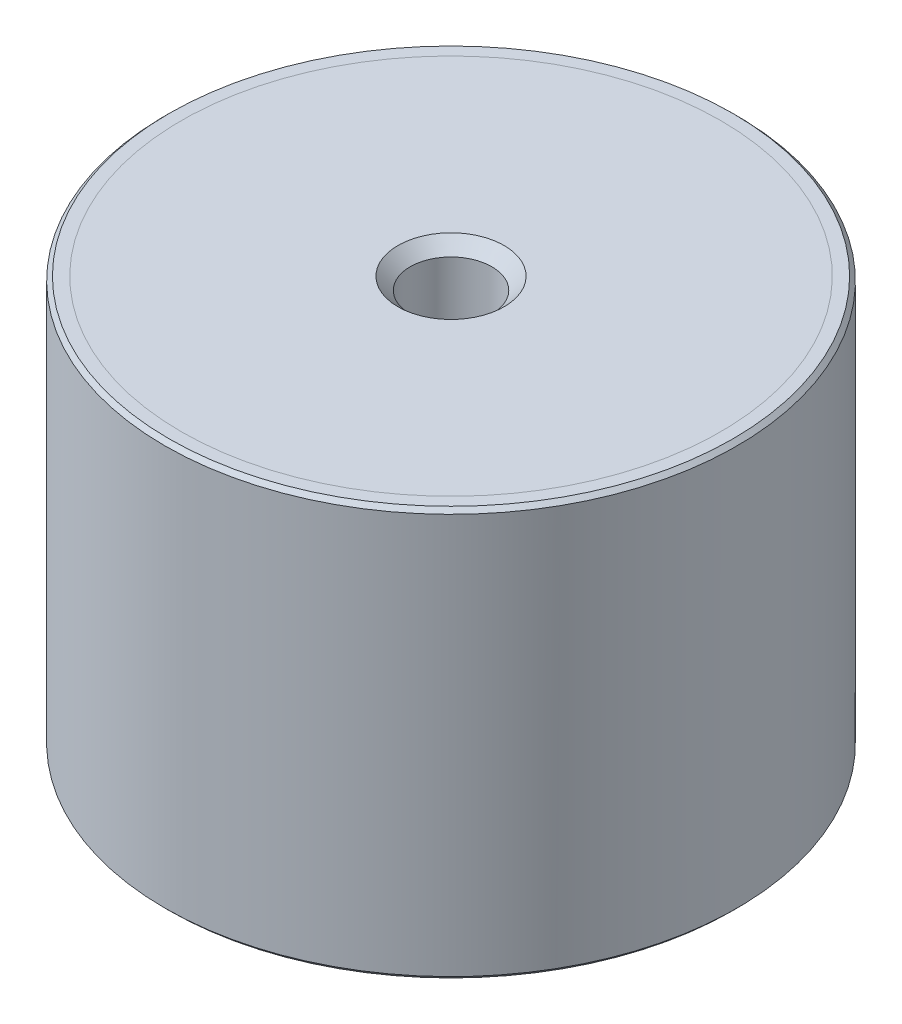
ISO-10303-21;
HEADER;
FILE_DESCRIPTION(('STEP AP214'),'2;1');
FILE_NAME('part.step','',(''),(''),'','','');
FILE_SCHEMA(('AUTOMOTIVE_DESIGN { 1 0 10303 214 1 1 1 1 }'));
ENDSEC;
DATA;
#1=APPLICATION_CONTEXT('core data for automotive mechanical design processes');
#2=APPLICATION_PROTOCOL_DEFINITION('international standard','automotive_design',2000,#1);
#3=PRODUCT_CONTEXT('',#1,'mechanical');
#4=PRODUCT('Part','Part','',(#3));
#5=PRODUCT_RELATED_PRODUCT_CATEGORY('part','',(#4));
#6=PRODUCT_DEFINITION_FORMATION('','',#4);
#7=PRODUCT_DEFINITION_CONTEXT('part definition',#1,'design');
#8=PRODUCT_DEFINITION('design','',#6,#7);
#9=PRODUCT_DEFINITION_SHAPE('','',#8);
#10=(LENGTH_UNIT() NAMED_UNIT(*) SI_UNIT(.MILLI.,.METRE.));
#11=(NAMED_UNIT(*) PLANE_ANGLE_UNIT() SI_UNIT($,.RADIAN.));
#12=(NAMED_UNIT(*) SI_UNIT($,.STERADIAN.) SOLID_ANGLE_UNIT());
#13=UNCERTAINTY_MEASURE_WITH_UNIT(LENGTH_MEASURE(1.E-05),#10,'distance_accuracy_value','');
#14=(GEOMETRIC_REPRESENTATION_CONTEXT(3) GLOBAL_UNCERTAINTY_ASSIGNED_CONTEXT((#13)) GLOBAL_UNIT_ASSIGNED_CONTEXT((#10,
#11,#12)) REPRESENTATION_CONTEXT('',''));
#15=CARTESIAN_POINT('',(0.,0.,0.));
#16=DIRECTION('',(0.,0.,1.));
#17=DIRECTION('',(1.,0.,0.));
#18=AXIS2_PLACEMENT_3D('',#15,#16,#17);
#19=CARTESIAN_POINT('',(0.,-47.,5.));
#20=DIRECTION('',(0.,1.,0.));
#21=DIRECTION('',(0.,0.,1.));
#22=AXIS2_PLACEMENT_3D('',#19,#20,#21);
#23=PLANE('',#22);
#24=CARTESIAN_POINT('',(0.,-47.,0.));
#25=DIRECTION('',(0.,1.,0.));
#26=DIRECTION('',(0.,0.,1.));
#27=AXIS2_PLACEMENT_3D('',#24,#25,#26);
#28=CIRCLE('',#27,33.);
#29=CARTESIAN_POINT('',(0.,-47.,33.));
#30=VERTEX_POINT('',#29);
#31=EDGE_CURVE('P0_E25',#30,#30,#28,.T.);
#32=ORIENTED_EDGE('',*,*,#31,.T.);
#33=EDGE_LOOP('',(#32));
#34=FACE_BOUND('',#33,.T.);
#35=CARTESIAN_POINT('',(0.,-47.,0.));
#36=DIRECTION('',(0.,1.,0.));
#37=DIRECTION('',(0.,0.,1.));
#38=AXIS2_PLACEMENT_3D('',#35,#36,#37);
#39=CIRCLE('',#38,5.);
#40=CARTESIAN_POINT('',(0.,-47.,5.));
#41=VERTEX_POINT('',#40);
#42=EDGE_CURVE('P0_E21',#41,#41,#39,.T.);
#43=ORIENTED_EDGE('',*,*,#42,.F.);
#44=EDGE_LOOP('',(#43));
#45=FACE_BOUND('',#44,.T.);
#46=ADVANCED_FACE('P0_F14',(#34,#45),#23,.T.);
#47=CARTESIAN_POINT('',(0.,21.0340428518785,0.));
#48=DIRECTION('',(0.,1.,0.));
#49=DIRECTION('',(0.,0.,1.));
#50=AXIS2_PLACEMENT_3D('',#47,#48,#49);
#51=CYLINDRICAL_SURFACE('',#50,33.);
#52=CARTESIAN_POINT('',(0.,-48.5,0.));
#53=DIRECTION('',(0.,1.,0.));
#54=DIRECTION('',(0.,0.,1.));
#55=AXIS2_PLACEMENT_3D('',#52,#53,#54);
#56=CIRCLE('',#55,33.);
#57=CARTESIAN_POINT('',(0.,-48.5,33.));
#58=VERTEX_POINT('',#57);
#59=EDGE_CURVE('P0_E29',#58,#58,#56,.T.);
#60=ORIENTED_EDGE('',*,*,#59,.T.);
#61=EDGE_LOOP('',(#60));
#62=FACE_BOUND('',#61,.T.);
#63=ORIENTED_EDGE('',*,*,#31,.F.);
#64=EDGE_LOOP('',(#63));
#65=FACE_BOUND('',#64,.T.);
#66=ADVANCED_FACE('P0_F35',(#62,#65),#51,.T.);
#67=CARTESIAN_POINT('',(0.,-48.5,33.));
#68=DIRECTION('',(0.,-1.,0.));
#69=DIRECTION('',(0.,0.,-1.));
#70=AXIS2_PLACEMENT_3D('',#67,#68,#69);
#71=PLANE('',#70);
#72=CARTESIAN_POINT('',(0.,-48.5,0.));
#73=DIRECTION('',(0.,-1.,0.));
#74=DIRECTION('',(0.,0.,-1.));
#75=AXIS2_PLACEMENT_3D('',#72,#73,#74);
#76=CIRCLE('',#75,6.50000000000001);
#77=CARTESIAN_POINT('',(0.,-48.5,-6.50000000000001));
#78=VERTEX_POINT('',#77);
#79=EDGE_CURVE('P0_E10',#78,#78,#76,.F.);
#80=ORIENTED_EDGE('',*,*,#79,.T.);
#81=EDGE_LOOP('',(#80));
#82=FACE_BOUND('',#81,.T.);
#83=ORIENTED_EDGE('',*,*,#59,.F.);
#84=EDGE_LOOP('',(#83));
#85=FACE_BOUND('',#84,.T.);
#86=ADVANCED_FACE('P0_F38',(#82,#85),#71,.T.);
#87=CARTESIAN_POINT('',(0.,-48.5,0.));
#88=DIRECTION('',(0.,-1.,0.));
#89=DIRECTION('',(0.,0.,-1.));
#90=AXIS2_PLACEMENT_3D('',#87,#88,#89);
#91=CONICAL_SURFACE('',#90,6.50000000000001,0.785398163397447);
#92=ORIENTED_EDGE('',*,*,#42,.T.);
#93=EDGE_LOOP('',(#92));
#94=FACE_BOUND('',#93,.T.);
#95=ORIENTED_EDGE('',*,*,#79,.F.);
#96=EDGE_LOOP('',(#95));
#97=FACE_BOUND('',#96,.T.);
#98=ADVANCED_FACE('P0_F16',(#94,#97),#91,.F.);
#99=CLOSED_SHELL('',(#46,#66,#86,#98));
#100=MANIFOLD_SOLID_BREP('P0_B1',#99);
#101=CARTESIAN_POINT('',(0.,1.5,5.));
#102=DIRECTION('',(0.,1.,0.));
#103=DIRECTION('',(0.,0.,1.));
#104=AXIS2_PLACEMENT_3D('',#101,#102,#103);
#105=PLANE('',#104);
#106=CARTESIAN_POINT('',(0.,1.5,0.));
#107=DIRECTION('',(0.,1.,0.));
#108=DIRECTION('',(0.,0.,1.));
#109=AXIS2_PLACEMENT_3D('',#106,#107,#108);
#110=CIRCLE('',#109,6.50000000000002);
#111=CARTESIAN_POINT('',(0.,1.5,6.50000000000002));
#112=VERTEX_POINT('',#111);
#113=EDGE_CURVE('P1_E10',#112,#112,#110,.F.);
#114=ORIENTED_EDGE('',*,*,#113,.T.);
#115=EDGE_LOOP('',(#114));
#116=FACE_BOUND('',#115,.T.);
#117=CARTESIAN_POINT('',(0.,1.5,0.));
#118=DIRECTION('',(0.,1.,0.));
#119=DIRECTION('',(0.,0.,1.));
#120=AXIS2_PLACEMENT_3D('',#117,#118,#119);
#121=CIRCLE('',#120,33.);
#122=CARTESIAN_POINT('',(0.,1.5,33.));
#123=VERTEX_POINT('',#122);
#124=EDGE_CURVE('P1_E21',#123,#123,#121,.T.);
#125=ORIENTED_EDGE('',*,*,#124,.T.);
#126=EDGE_LOOP('',(#125));
#127=FACE_BOUND('',#126,.T.);
#128=ADVANCED_FACE('P1_F14',(#116,#127),#105,.T.);
#129=CARTESIAN_POINT('',(0.,69.5340428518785,0.));
#130=DIRECTION('',(0.,1.,0.));
#131=DIRECTION('',(0.,0.,1.));
#132=AXIS2_PLACEMENT_3D('',#129,#130,#131);
#133=CYLINDRICAL_SURFACE('',#132,33.);
#134=CARTESIAN_POINT('',(0.,0.,0.));
#135=DIRECTION('',(0.,1.,0.));
#136=DIRECTION('',(0.,0.,1.));
#137=AXIS2_PLACEMENT_3D('',#134,#135,#136);
#138=CIRCLE('',#137,33.);
#139=CARTESIAN_POINT('',(0.,0.,33.));
#140=VERTEX_POINT('',#139);
#141=EDGE_CURVE('P1_E25',#140,#140,#138,.T.);
#142=ORIENTED_EDGE('',*,*,#141,.T.);
#143=EDGE_LOOP('',(#142));
#144=FACE_BOUND('',#143,.T.);
#145=ORIENTED_EDGE('',*,*,#124,.F.);
#146=EDGE_LOOP('',(#145));
#147=FACE_BOUND('',#146,.T.);
#148=ADVANCED_FACE('P1_F44',(#144,#147),#133,.T.);
#149=CARTESIAN_POINT('',(0.,0.,33.));
#150=DIRECTION('',(0.,-1.,0.));
#151=DIRECTION('',(0.,0.,-1.));
#152=AXIS2_PLACEMENT_3D('',#149,#150,#151);
#153=PLANE('',#152);
#154=CARTESIAN_POINT('',(0.,0.,0.));
#155=DIRECTION('',(0.,1.,0.));
#156=DIRECTION('',(0.,0.,1.));
#157=AXIS2_PLACEMENT_3D('',#154,#155,#156);
#158=CIRCLE('',#157,5.);
#159=CARTESIAN_POINT('',(0.,0.,5.));
#160=VERTEX_POINT('',#159);
#161=EDGE_CURVE('P1_E29',#160,#160,#158,.T.);
#162=ORIENTED_EDGE('',*,*,#161,.T.);
#163=EDGE_LOOP('',(#162));
#164=FACE_BOUND('',#163,.T.);
#165=ORIENTED_EDGE('',*,*,#141,.F.);
#166=EDGE_LOOP('',(#165));
#167=FACE_BOUND('',#166,.T.);
#168=ADVANCED_FACE('P1_F35',(#164,#167),#153,.T.);
#169=CARTESIAN_POINT('',(0.,0.,0.));
#170=DIRECTION('',(0.,1.,0.));
#171=DIRECTION('',(0.,0.,1.));
#172=AXIS2_PLACEMENT_3D('',#169,#170,#171);
#173=CONICAL_SURFACE('',#172,5.,0.785398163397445);
#174=ORIENTED_EDGE('',*,*,#113,.F.);
#175=EDGE_LOOP('',(#174));
#176=FACE_BOUND('',#175,.T.);
#177=ORIENTED_EDGE('',*,*,#161,.F.);
#178=EDGE_LOOP('',(#177));
#179=FACE_BOUND('',#178,.T.);
#180=ADVANCED_FACE('P1_F16',(#176,#179),#173,.F.);
#181=CLOSED_SHELL('',(#128,#148,#168,#180));
#182=MANIFOLD_SOLID_BREP('P1_B1',#181);
#183=CARTESIAN_POINT('',(0.,0.,0.));
#184=DIRECTION('',(0.,1.,0.));
#185=DIRECTION('',(0.,0.,1.));
#186=AXIS2_PLACEMENT_3D('',#183,#184,#185);
#187=PLANE('',#186);
#188=CARTESIAN_POINT('',(0.,0.,0.));
#189=DIRECTION('',(0.,1.,0.));
#190=DIRECTION('',(0.,0.,1.));
#191=AXIS2_PLACEMENT_3D('',#188,#189,#190);
#192=CIRCLE('',#191,5.);
#193=CARTESIAN_POINT('',(0.,0.,5.));
#194=VERTEX_POINT('',#193);
#195=EDGE_CURVE('P2_E46',#194,#194,#192,.T.);
#196=ORIENTED_EDGE('',*,*,#195,.F.);
#197=EDGE_LOOP('',(#196));
#198=FACE_BOUND('',#197,.T.);
#199=CARTESIAN_POINT('',(0.,0.,0.));
#200=DIRECTION('',(0.,1.,0.));
#201=DIRECTION('',(0.,0.,1.));
#202=AXIS2_PLACEMENT_3D('',#199,#200,#201);
#203=CIRCLE('',#202,33.);
#204=CARTESIAN_POINT('',(0.,0.,33.));
#205=VERTEX_POINT('',#204);
#206=EDGE_CURVE('P2_E33',#205,#205,#203,.T.);
#207=ORIENTED_EDGE('',*,*,#206,.T.);
#208=EDGE_LOOP('',(#207));
#209=FACE_BOUND('',#208,.T.);
#210=ADVANCED_FACE('P2_F13',(#198,#209),#187,.T.);
#211=CARTESIAN_POINT('',(0.,65.5134936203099,0.));
#212=DIRECTION('',(0.,1.,0.));
#213=DIRECTION('',(0.,0.,1.));
#214=AXIS2_PLACEMENT_3D('',#211,#212,#213);
#215=CYLINDRICAL_SURFACE('',#214,33.);
#216=CARTESIAN_POINT('',(0.,1.5,0.));
#217=DIRECTION('',(0.,1.,0.));
#218=DIRECTION('',(0.,0.,1.));
#219=AXIS2_PLACEMENT_3D('',#216,#217,#218);
#220=CIRCLE('',#219,33.);
#221=CARTESIAN_POINT('',(0.,1.5,33.));
#222=VERTEX_POINT('',#221);
#223=EDGE_CURVE('P2_E36',#222,#222,#220,.T.);
#224=ORIENTED_EDGE('',*,*,#223,.T.);
#225=EDGE_LOOP('',(#224));
#226=FACE_BOUND('',#225,.T.);
#227=ORIENTED_EDGE('',*,*,#206,.F.);
#228=EDGE_LOOP('',(#227));
#229=FACE_BOUND('',#228,.T.);
#230=ADVANCED_FACE('P2_F92',(#226,#229),#215,.F.);
#231=CARTESIAN_POINT('',(0.,1.5,33.));
#232=DIRECTION('',(0.,1.,0.));
#233=DIRECTION('',(0.,0.,1.));
#234=AXIS2_PLACEMENT_3D('',#231,#232,#233);
#235=PLANE('',#234);
#236=CARTESIAN_POINT('',(0.,1.5,0.));
#237=DIRECTION('',(0.,1.,0.));
#238=DIRECTION('',(0.,0.,1.));
#239=AXIS2_PLACEMENT_3D('',#236,#237,#238);
#240=CIRCLE('',#239,34.5);
#241=CARTESIAN_POINT('',(0.,1.5,34.5));
#242=VERTEX_POINT('',#241);
#243=EDGE_CURVE('P2_E9',#242,#242,#240,.T.);
#244=ORIENTED_EDGE('',*,*,#243,.T.);
#245=EDGE_LOOP('',(#244));
#246=FACE_BOUND('',#245,.T.);
#247=ORIENTED_EDGE('',*,*,#223,.F.);
#248=EDGE_LOOP('',(#247));
#249=FACE_BOUND('',#248,.T.);
#250=ADVANCED_FACE('P2_F88',(#246,#249),#235,.T.);
#251=CARTESIAN_POINT('',(0.,65.5134936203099,0.));
#252=DIRECTION('',(0.,1.,0.));
#253=DIRECTION('',(0.,0.,1.));
#254=AXIS2_PLACEMENT_3D('',#251,#252,#253);
#255=CYLINDRICAL_SURFACE('',#254,35.);
#256=CARTESIAN_POINT('',(0.,-48.,0.));
#257=DIRECTION('',(0.,-1.,0.));
#258=DIRECTION('',(0.,0.,-1.));
#259=AXIS2_PLACEMENT_3D('',#256,#257,#258);
#260=CIRCLE('',#259,35.);
#261=CARTESIAN_POINT('',(0.,-48.,-35.));
#262=VERTEX_POINT('',#261);
#263=EDGE_CURVE('P2_E24',#262,#262,#260,.F.);
#264=ORIENTED_EDGE('',*,*,#263,.T.);
#265=EDGE_LOOP('',(#264));
#266=FACE_BOUND('',#265,.T.);
#267=CARTESIAN_POINT('',(0.,0.999999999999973,0.));
#268=DIRECTION('',(0.,1.,0.));
#269=DIRECTION('',(0.,0.,1.));
#270=AXIS2_PLACEMENT_3D('',#267,#268,#269);
#271=CIRCLE('',#270,35.);
#272=CARTESIAN_POINT('',(0.,0.999999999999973,35.));
#273=VERTEX_POINT('',#272);
#274=EDGE_CURVE('P2_E28',#273,#273,#271,.F.);
#275=ORIENTED_EDGE('',*,*,#274,.T.);
#276=EDGE_LOOP('',(#275));
#277=FACE_BOUND('',#276,.T.);
#278=ADVANCED_FACE('P2_F82',(#266,#277),#255,.T.);
#279=CARTESIAN_POINT('',(0.,-48.5,35.));
#280=DIRECTION('',(0.,-1.,0.));
#281=DIRECTION('',(0.,0.,-1.));
#282=AXIS2_PLACEMENT_3D('',#279,#280,#281);
#283=PLANE('',#282);
#284=CARTESIAN_POINT('',(0.,-48.5,0.));
#285=DIRECTION('',(0.,-1.,0.));
#286=DIRECTION('',(0.,0.,-1.));
#287=AXIS2_PLACEMENT_3D('',#284,#285,#286);
#288=CIRCLE('',#287,34.5);
#289=CARTESIAN_POINT('',(0.,-48.5,-34.5));
#290=VERTEX_POINT('',#289);
#291=EDGE_CURVE('P2_E20',#290,#290,#288,.T.);
#292=ORIENTED_EDGE('',*,*,#291,.T.);
#293=EDGE_LOOP('',(#292));
#294=FACE_BOUND('',#293,.T.);
#295=CARTESIAN_POINT('',(0.,-48.5,0.));
#296=DIRECTION('',(0.,1.,0.));
#297=DIRECTION('',(0.,0.,1.));
#298=AXIS2_PLACEMENT_3D('',#295,#296,#297);
#299=CIRCLE('',#298,33.);
#300=CARTESIAN_POINT('',(0.,-48.5,33.));
#301=VERTEX_POINT('',#300);
#302=EDGE_CURVE('P2_E39',#301,#301,#299,.T.);
#303=ORIENTED_EDGE('',*,*,#302,.T.);
#304=EDGE_LOOP('',(#303));
#305=FACE_BOUND('',#304,.T.);
#306=ADVANCED_FACE('P2_F77',(#294,#305),#283,.T.);
#307=CARTESIAN_POINT('',(0.,65.5134936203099,0.));
#308=DIRECTION('',(0.,1.,0.));
#309=DIRECTION('',(0.,0.,1.));
#310=AXIS2_PLACEMENT_3D('',#307,#308,#309);
#311=CYLINDRICAL_SURFACE('',#310,33.);
#312=CARTESIAN_POINT('',(0.,-47.,0.));
#313=DIRECTION('',(0.,1.,0.));
#314=DIRECTION('',(0.,0.,1.));
#315=AXIS2_PLACEMENT_3D('',#312,#313,#314);
#316=CIRCLE('',#315,33.);
#317=CARTESIAN_POINT('',(0.,-47.,33.));
#318=VERTEX_POINT('',#317);
#319=EDGE_CURVE('P2_E42',#318,#318,#316,.T.);
#320=ORIENTED_EDGE('',*,*,#319,.T.);
#321=EDGE_LOOP('',(#320));
#322=FACE_BOUND('',#321,.T.);
#323=ORIENTED_EDGE('',*,*,#302,.F.);
#324=EDGE_LOOP('',(#323));
#325=FACE_BOUND('',#324,.T.);
#326=ADVANCED_FACE('P2_F71',(#322,#325),#311,.F.);
#327=CARTESIAN_POINT('',(0.,-47.,33.));
#328=DIRECTION('',(0.,-1.,0.));
#329=DIRECTION('',(0.,0.,-1.));
#330=AXIS2_PLACEMENT_3D('',#327,#328,#329);
#331=PLANE('',#330);
#332=CARTESIAN_POINT('',(0.,-47.,0.));
#333=DIRECTION('',(0.,-1.,0.));
#334=DIRECTION('',(0.,0.,-1.));
#335=AXIS2_PLACEMENT_3D('',#332,#333,#334);
#336=CIRCLE('',#335,5.);
#337=CARTESIAN_POINT('',(0.,-47.,-5.));
#338=VERTEX_POINT('',#337);
#339=EDGE_CURVE('P2_E52',#338,#338,#336,.T.);
#340=ORIENTED_EDGE('',*,*,#339,.F.);
#341=EDGE_LOOP('',(#340));
#342=FACE_BOUND('',#341,.T.);
#343=ORIENTED_EDGE('',*,*,#319,.F.);
#344=EDGE_LOOP('',(#343));
#345=FACE_BOUND('',#344,.T.);
#346=ADVANCED_FACE('P2_F67',(#342,#345),#331,.T.);
#347=CARTESIAN_POINT('',(0.,-48.,0.));
#348=DIRECTION('',(0.,1.,0.));
#349=DIRECTION('',(0.,0.,1.));
#350=AXIS2_PLACEMENT_3D('',#347,#348,#349);
#351=CONICAL_SURFACE('',#350,35.,0.785398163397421);
#352=ORIENTED_EDGE('',*,*,#291,.F.);
#353=EDGE_LOOP('',(#352));
#354=FACE_BOUND('',#353,.T.);
#355=ORIENTED_EDGE('',*,*,#263,.F.);
#356=EDGE_LOOP('',(#355));
#357=FACE_BOUND('',#356,.T.);
#358=ADVANCED_FACE('P2_F70',(#354,#357),#351,.T.);
#359=CARTESIAN_POINT('',(0.,1.5,0.));
#360=DIRECTION('',(0.,-1.,0.));
#361=DIRECTION('',(0.,0.,-1.));
#362=AXIS2_PLACEMENT_3D('',#359,#360,#361);
#363=CONICAL_SURFACE('',#362,34.5,0.785398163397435);
#364=ORIENTED_EDGE('',*,*,#274,.F.);
#365=EDGE_LOOP('',(#364));
#366=FACE_BOUND('',#365,.T.);
#367=ORIENTED_EDGE('',*,*,#243,.F.);
#368=EDGE_LOOP('',(#367));
#369=FACE_BOUND('',#368,.T.);
#370=ADVANCED_FACE('P2_F15',(#366,#369),#363,.T.);
#371=CARTESIAN_POINT('',(0.,-8.5,0.));
#372=DIRECTION('',(0.,1.,0.));
#373=DIRECTION('',(0.,0.,1.));
#374=AXIS2_PLACEMENT_3D('',#371,#372,#373);
#375=CYLINDRICAL_SURFACE('',#374,5.);
#376=CARTESIAN_POINT('',(0.,-8.5,0.));
#377=DIRECTION('',(0.,1.,0.));
#378=DIRECTION('',(0.,0.,1.));
#379=AXIS2_PLACEMENT_3D('',#376,#377,#378);
#380=CIRCLE('',#379,5.);
#381=CARTESIAN_POINT('',(0.,-8.5,5.));
#382=VERTEX_POINT('',#381);
#383=EDGE_CURVE('P2_E45',#382,#382,#380,.T.);
#384=ORIENTED_EDGE('',*,*,#383,.F.);
#385=EDGE_LOOP('',(#384));
#386=FACE_BOUND('',#385,.T.);
#387=ORIENTED_EDGE('',*,*,#195,.T.);
#388=EDGE_LOOP('',(#387));
#389=FACE_BOUND('',#388,.T.);
#390=ADVANCED_FACE('P2_F108',(#386,#389),#375,.F.);
#391=CARTESIAN_POINT('',(0.,-8.5,0.));
#392=DIRECTION('',(0.,1.,0.));
#393=DIRECTION('',(0.,0.,1.));
#394=AXIS2_PLACEMENT_3D('',#391,#392,#393);
#395=PLANE('',#394);
#396=ORIENTED_EDGE('',*,*,#383,.T.);
#397=EDGE_LOOP('',(#396));
#398=FACE_BOUND('',#397,.T.);
#399=ADVANCED_FACE('P2_F63',(#398),#395,.T.);
#400=CARTESIAN_POINT('',(0.,-38.5,0.));
#401=DIRECTION('',(0.,-1.,0.));
#402=DIRECTION('',(0.,0.,-1.));
#403=AXIS2_PLACEMENT_3D('',#400,#401,#402);
#404=CYLINDRICAL_SURFACE('',#403,5.);
#405=CARTESIAN_POINT('',(0.,-38.5,0.));
#406=DIRECTION('',(0.,-1.,0.));
#407=DIRECTION('',(0.,0.,-1.));
#408=AXIS2_PLACEMENT_3D('',#405,#406,#407);
#409=CIRCLE('',#408,5.);
#410=CARTESIAN_POINT('',(0.,-38.5,-5.));
#411=VERTEX_POINT('',#410);
#412=EDGE_CURVE('P2_E49',#411,#411,#409,.T.);
#413=ORIENTED_EDGE('',*,*,#412,.F.);
#414=EDGE_LOOP('',(#413));
#415=FACE_BOUND('',#414,.T.);
#416=ORIENTED_EDGE('',*,*,#339,.T.);
#417=EDGE_LOOP('',(#416));
#418=FACE_BOUND('',#417,.T.);
#419=ADVANCED_FACE('P2_F60',(#415,#418),#404,.F.);
#420=CARTESIAN_POINT('',(0.,-38.5,0.));
#421=DIRECTION('',(0.,-1.,0.));
#422=DIRECTION('',(0.,0.,-1.));
#423=AXIS2_PLACEMENT_3D('',#420,#421,#422);
#424=PLANE('',#423);
#425=ORIENTED_EDGE('',*,*,#412,.T.);
#426=EDGE_LOOP('',(#425));
#427=FACE_BOUND('',#426,.T.);
#428=ADVANCED_FACE('P2_F58',(#427),#424,.T.);
#429=CLOSED_SHELL('',(#210,#230,#250,#278,#306,#326,#346,#358,#370,#390,#399,#419,#428));
#430=MANIFOLD_SOLID_BREP('P2_B1',#429);
#431=ADVANCED_BREP_SHAPE_REPRESENTATION('',(#18,#100,#182,#430),#14);
#432=SHAPE_DEFINITION_REPRESENTATION(#9,#431);
ENDSEC;
END-ISO-10303-21;
